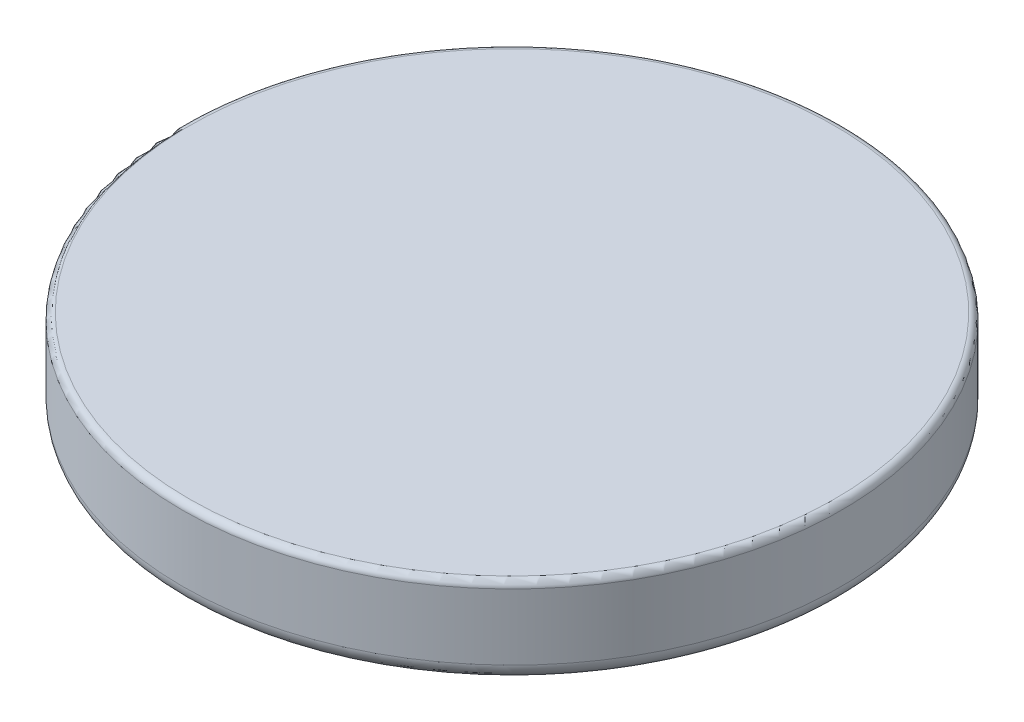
ISO-10303-21;
HEADER;
FILE_DESCRIPTION(('STEP AP214'),'2;1');
FILE_NAME('part.step','',(''),(''),'','','');
FILE_SCHEMA(('AUTOMOTIVE_DESIGN { 1 0 10303 214 1 1 1 1 }'));
ENDSEC;
DATA;
#1=APPLICATION_CONTEXT('core data for automotive mechanical design processes');
#2=APPLICATION_PROTOCOL_DEFINITION('international standard','automotive_design',2000,#1);
#3=PRODUCT_CONTEXT('',#1,'mechanical');
#4=PRODUCT('Part','Part','',(#3));
#5=PRODUCT_RELATED_PRODUCT_CATEGORY('part','',(#4));
#6=PRODUCT_DEFINITION_FORMATION('','',#4);
#7=PRODUCT_DEFINITION_CONTEXT('part definition',#1,'design');
#8=PRODUCT_DEFINITION('design','',#6,#7);
#9=PRODUCT_DEFINITION_SHAPE('','',#8);
#10=(LENGTH_UNIT() NAMED_UNIT(*) SI_UNIT(.MILLI.,.METRE.));
#11=(NAMED_UNIT(*) PLANE_ANGLE_UNIT() SI_UNIT($,.RADIAN.));
#12=(NAMED_UNIT(*) SI_UNIT($,.STERADIAN.) SOLID_ANGLE_UNIT());
#13=UNCERTAINTY_MEASURE_WITH_UNIT(LENGTH_MEASURE(1.E-05),#10,'distance_accuracy_value','');
#14=(GEOMETRIC_REPRESENTATION_CONTEXT(3) GLOBAL_UNCERTAINTY_ASSIGNED_CONTEXT((#13)) GLOBAL_UNIT_ASSIGNED_CONTEXT((#10,
#11,#12)) REPRESENTATION_CONTEXT('',''));
#15=CARTESIAN_POINT('',(0.,0.,0.));
#16=DIRECTION('',(0.,0.,1.));
#17=DIRECTION('',(1.,0.,0.));
#18=AXIS2_PLACEMENT_3D('',#15,#16,#17);
#19=CARTESIAN_POINT('',(0.,3.1,0.));
#20=DIRECTION('',(0.,-1.,0.));
#21=DIRECTION('',(0.,0.,-1.));
#22=AXIS2_PLACEMENT_3D('',#19,#20,#21);
#23=CYLINDRICAL_SURFACE('',#22,10.);
#24=CARTESIAN_POINT('',(0.,0.9,0.));
#25=DIRECTION('',(0.,-1.,0.));
#26=DIRECTION('',(0.,0.,-1.));
#27=AXIS2_PLACEMENT_3D('',#24,#25,#26);
#28=CIRCLE('',#27,10.);
#29=CARTESIAN_POINT('',(0.,0.900000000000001,-10.));
#30=VERTEX_POINT('',#29);
#31=EDGE_CURVE('E10',#30,#30,#28,.F.);
#32=CARTESIAN_POINT('',(0.,2.9,0.));
#33=DIRECTION('',(0.,1.,0.));
#34=DIRECTION('',(0.,0.,1.));
#35=AXIS2_PLACEMENT_3D('',#32,#33,#34);
#36=CIRCLE('',#35,10.);
#37=CARTESIAN_POINT('',(0.,2.9,-10.));
#38=VERTEX_POINT('',#37);
#39=EDGE_CURVE('E51',#38,#38,#36,.F.);
#40=CARTESIAN_POINT('',(0.,0.900000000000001,-10.));
#41=CARTESIAN_POINT('',(0.,0.920833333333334,-10.));
#42=CARTESIAN_POINT('',(0.,0.941666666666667,-10.));
#43=CARTESIAN_POINT('',(0.,0.983333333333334,-10.));
#44=CARTESIAN_POINT('',(0.,1.00416666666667,-10.));
#45=CARTESIAN_POINT('',(0.,1.04583333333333,-10.));
#46=CARTESIAN_POINT('',(0.,1.06666666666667,-10.));
#47=CARTESIAN_POINT('',(0.,1.10833333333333,-10.));
#48=CARTESIAN_POINT('',(0.,1.12916666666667,-10.));
#49=CARTESIAN_POINT('',(0.,1.17083333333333,-10.));
#50=CARTESIAN_POINT('',(0.,1.19166666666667,-10.));
#51=CARTESIAN_POINT('',(0.,1.23333333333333,-10.));
#52=CARTESIAN_POINT('',(0.,1.25416666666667,-10.));
#53=CARTESIAN_POINT('',(0.,1.29583333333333,-10.));
#54=CARTESIAN_POINT('',(0.,1.31666666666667,-10.));
#55=CARTESIAN_POINT('',(0.,1.35833333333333,-10.));
#56=CARTESIAN_POINT('',(0.,1.37916666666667,-10.));
#57=CARTESIAN_POINT('',(0.,1.42083333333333,-10.));
#58=CARTESIAN_POINT('',(0.,1.44166666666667,-10.));
#59=CARTESIAN_POINT('',(0.,1.48333333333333,-10.));
#60=CARTESIAN_POINT('',(0.,1.50416666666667,-10.));
#61=CARTESIAN_POINT('',(0.,1.54583333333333,-10.));
#62=CARTESIAN_POINT('',(0.,1.56666666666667,-10.));
#63=CARTESIAN_POINT('',(0.,1.60833333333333,-10.));
#64=CARTESIAN_POINT('',(0.,1.62916666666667,-10.));
#65=CARTESIAN_POINT('',(0.,1.67083333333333,-10.));
#66=CARTESIAN_POINT('',(0.,1.69166666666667,-10.));
#67=CARTESIAN_POINT('',(0.,1.73333333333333,-10.));
#68=CARTESIAN_POINT('',(0.,1.75416666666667,-10.));
#69=CARTESIAN_POINT('',(0.,1.79583333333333,-10.));
#70=CARTESIAN_POINT('',(0.,1.81666666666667,-10.));
#71=CARTESIAN_POINT('',(0.,1.85833333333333,-10.));
#72=CARTESIAN_POINT('',(0.,1.87916666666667,-10.));
#73=CARTESIAN_POINT('',(0.,1.92083333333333,-10.));
#74=CARTESIAN_POINT('',(0.,1.94166666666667,-10.));
#75=CARTESIAN_POINT('',(0.,1.98333333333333,-10.));
#76=CARTESIAN_POINT('',(0.,2.00416666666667,-10.));
#77=CARTESIAN_POINT('',(0.,2.04583333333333,-10.));
#78=CARTESIAN_POINT('',(0.,2.06666666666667,-10.));
#79=CARTESIAN_POINT('',(0.,2.10833333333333,-10.));
#80=CARTESIAN_POINT('',(0.,2.12916666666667,-10.));
#81=CARTESIAN_POINT('',(0.,2.17083333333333,-10.));
#82=CARTESIAN_POINT('',(0.,2.19166666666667,-10.));
#83=CARTESIAN_POINT('',(0.,2.23333333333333,-10.));
#84=CARTESIAN_POINT('',(0.,2.25416666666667,-10.));
#85=CARTESIAN_POINT('',(0.,2.29583333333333,-10.));
#86=CARTESIAN_POINT('',(0.,2.31666666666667,-10.));
#87=CARTESIAN_POINT('',(0.,2.35833333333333,-10.));
#88=CARTESIAN_POINT('',(0.,2.37916666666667,-10.));
#89=CARTESIAN_POINT('',(0.,2.42083333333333,-10.));
#90=CARTESIAN_POINT('',(0.,2.44166666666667,-10.));
#91=CARTESIAN_POINT('',(0.,2.48333333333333,-10.));
#92=CARTESIAN_POINT('',(0.,2.50416666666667,-10.));
#93=CARTESIAN_POINT('',(0.,2.54583333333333,-10.));
#94=CARTESIAN_POINT('',(0.,2.56666666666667,-10.));
#95=CARTESIAN_POINT('',(0.,2.60833333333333,-10.));
#96=CARTESIAN_POINT('',(0.,2.62916666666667,-10.));
#97=CARTESIAN_POINT('',(0.,2.67083333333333,-10.));
#98=CARTESIAN_POINT('',(0.,2.69166666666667,-10.));
#99=CARTESIAN_POINT('',(0.,2.73333333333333,-10.));
#100=CARTESIAN_POINT('',(0.,2.75416666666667,-10.));
#101=CARTESIAN_POINT('',(0.,2.79583333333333,-10.));
#102=CARTESIAN_POINT('',(0.,2.81666666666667,-10.));
#103=CARTESIAN_POINT('',(0.,2.85833333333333,-10.));
#104=CARTESIAN_POINT('',(0.,2.87916666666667,-10.));
#105=CARTESIAN_POINT('',(0.,2.9,-10.));
#106=B_SPLINE_CURVE_WITH_KNOTS('',3,(#40,#41,#42,#43,#44,#45,#46,#47,#48,#49,#50,#51,#52,#53,
#54,#55,#56,#57,#58,#59,#60,#61,#62,#63,#64,#65,#66,#67,#68,#69,#70,#71,#72,#73,#74,#75,#76,#77,
#78,#79,#80,#81,#82,#83,#84,#85,#86,#87,#88,#89,#90,#91,#92,#93,#94,#95,#96,#97,#98,#99,#100,
#101,#102,#103,#104,#105),.UNSPECIFIED.,.F.,.F.,(4,2,2,2,2,2,2,2,2,2,2,2,2,2,2,2,2,2,2,2,2,2,2,
2,2,2,2,2,2,2,2,2,4),(0.,0.0625000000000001,0.125,0.1875,0.25,0.3125,0.375,0.4375,0.5,
0.562499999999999,0.624999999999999,0.6875,0.75,0.812499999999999,0.874999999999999,
0.937499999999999,0.999999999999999,1.0625,1.125,1.1875,1.25,1.3125,1.375,1.4375,1.5,1.5625,
1.625,1.6875,1.75,1.8125,1.875,1.9375,2.),.UNSPECIFIED.);
#107=EDGE_CURVE('BSEAM31',#30,#38,#106,.T.);
#108=ORIENTED_EDGE('',*,*,#31,.T.);
#109=ORIENTED_EDGE('',*,*,#39,.T.);
#110=ORIENTED_EDGE('',*,*,#107,.T.);
#111=ORIENTED_EDGE('',*,*,#107,.F.);
#112=EDGE_LOOP('',(#108,#110,#109,#111));
#113=FACE_BOUND('',#112,.T.);
#114=ADVANCED_FACE('F31',(#113),#23,.T.);
#115=CARTESIAN_POINT('',(0.,3.1,0.));
#116=DIRECTION('',(0.,1.,0.));
#117=DIRECTION('',(0.,0.,1.));
#118=AXIS2_PLACEMENT_3D('',#115,#116,#117);
#119=PLANE('',#118);
#120=CARTESIAN_POINT('',(0.,3.1,0.));
#121=DIRECTION('',(0.,1.,0.));
#122=DIRECTION('',(0.,0.,1.));
#123=AXIS2_PLACEMENT_3D('',#120,#121,#122);
#124=CIRCLE('',#123,9.8);
#125=CARTESIAN_POINT('',(0.,3.1,9.8));
#126=VERTEX_POINT('',#125);
#127=EDGE_CURVE('E54',#126,#126,#124,.T.);
#128=ORIENTED_EDGE('',*,*,#127,.T.);
#129=EDGE_LOOP('',(#128));
#130=FACE_BOUND('',#129,.T.);
#131=ADVANCED_FACE('F65',(#130),#119,.T.);
#132=CARTESIAN_POINT('',(0.,0.4,0.));
#133=DIRECTION('',(0.,-1.,0.));
#134=DIRECTION('',(0.,0.,-1.));
#135=AXIS2_PLACEMENT_3D('',#132,#133,#134);
#136=PLANE('',#135);
#137=CARTESIAN_POINT('',(0.,0.4,0.));
#138=DIRECTION('',(0.,-1.,0.));
#139=DIRECTION('',(0.,0.,-1.));
#140=AXIS2_PLACEMENT_3D('',#137,#138,#139);
#141=CIRCLE('',#140,9.5);
#142=CARTESIAN_POINT('',(0.,0.4,-9.5));
#143=VERTEX_POINT('',#142);
#144=EDGE_CURVE('E38',#143,#143,#141,.T.);
#145=ORIENTED_EDGE('',*,*,#144,.T.);
#146=EDGE_LOOP('',(#145));
#147=FACE_BOUND('',#146,.T.);
#148=CARTESIAN_POINT('',(0.,0.4,0.));
#149=DIRECTION('',(0.,-1.,0.));
#150=DIRECTION('',(0.,0.,-1.));
#151=AXIS2_PLACEMENT_3D('',#148,#149,#150);
#152=CIRCLE('',#151,9.);
#153=CARTESIAN_POINT('',(0.,0.4,-9.));
#154=VERTEX_POINT('',#153);
#155=EDGE_CURVE('E57',#154,#154,#152,.T.);
#156=ORIENTED_EDGE('',*,*,#155,.F.);
#157=EDGE_LOOP('',(#156));
#158=FACE_BOUND('',#157,.T.);
#159=ADVANCED_FACE('F63',(#147,#158),#136,.T.);
#160=CARTESIAN_POINT('',(0.,0.4,0.));
#161=DIRECTION('',(0.,-1.,0.));
#162=DIRECTION('',(0.,0.,-1.));
#163=AXIS2_PLACEMENT_3D('',#160,#161,#162);
#164=CYLINDRICAL_SURFACE('',#163,9.);
#165=CARTESIAN_POINT('',(0.,0.2,0.));
#166=DIRECTION('',(0.,1.,0.));
#167=DIRECTION('',(0.,0.,1.));
#168=AXIS2_PLACEMENT_3D('',#165,#166,#167);
#169=CIRCLE('',#168,9.);
#170=CARTESIAN_POINT('',(0.,0.2,9.));
#171=VERTEX_POINT('',#170);
#172=EDGE_CURVE('E42',#171,#171,#169,.T.);
#173=ORIENTED_EDGE('',*,*,#172,.T.);
#174=EDGE_LOOP('',(#173));
#175=FACE_BOUND('',#174,.T.);
#176=ORIENTED_EDGE('',*,*,#155,.T.);
#177=EDGE_LOOP('',(#176));
#178=FACE_BOUND('',#177,.T.);
#179=ADVANCED_FACE('F61',(#175,#178),#164,.T.);
#180=CARTESIAN_POINT('',(0.,0.,0.));
#181=DIRECTION('',(0.,1.,0.));
#182=DIRECTION('',(0.,0.,1.));
#183=AXIS2_PLACEMENT_3D('',#180,#181,#182);
#184=PLANE('',#183);
#185=CARTESIAN_POINT('',(0.,0.,0.));
#186=DIRECTION('',(0.,1.,0.));
#187=DIRECTION('',(0.,0.,1.));
#188=AXIS2_PLACEMENT_3D('',#185,#186,#187);
#189=CIRCLE('',#188,8.8);
#190=CARTESIAN_POINT('',(0.,0.,8.8));
#191=VERTEX_POINT('',#190);
#192=EDGE_CURVE('E46',#191,#191,#189,.F.);
#193=ORIENTED_EDGE('',*,*,#192,.T.);
#194=EDGE_LOOP('',(#193));
#195=FACE_BOUND('',#194,.T.);
#196=ADVANCED_FACE('F71',(#195),#184,.F.);
#197=CARTESIAN_POINT('',(0.,2.9,0.));
#198=DIRECTION('',(0.,1.,0.));
#199=DIRECTION('',(0.,0.,1.));
#200=AXIS2_PLACEMENT_3D('',#197,#198,#199);
#201=TOROIDAL_SURFACE('',#200,9.8,0.2);
#202=ORIENTED_EDGE('',*,*,#39,.F.);
#203=EDGE_LOOP('',(#202));
#204=FACE_BOUND('',#203,.T.);
#205=ORIENTED_EDGE('',*,*,#127,.F.);
#206=EDGE_LOOP('',(#205));
#207=FACE_BOUND('',#206,.T.);
#208=ADVANCED_FACE('F85',(#204,#207),#201,.T.);
#209=CARTESIAN_POINT('',(0.,0.2,0.));
#210=DIRECTION('',(0.,1.,0.));
#211=DIRECTION('',(0.,0.,1.));
#212=AXIS2_PLACEMENT_3D('',#209,#210,#211);
#213=TOROIDAL_SURFACE('',#212,8.8,0.2);
#214=ORIENTED_EDGE('',*,*,#172,.F.);
#215=EDGE_LOOP('',(#214));
#216=FACE_BOUND('',#215,.T.);
#217=ORIENTED_EDGE('',*,*,#192,.F.);
#218=EDGE_LOOP('',(#217));
#219=FACE_BOUND('',#218,.T.);
#220=ADVANCED_FACE('F87',(#216,#219),#213,.T.);
#221=CARTESIAN_POINT('',(0.,0.9,0.));
#222=DIRECTION('',(0.,-1.,0.));
#223=DIRECTION('',(0.,0.,-1.));
#224=AXIS2_PLACEMENT_3D('',#221,#222,#223);
#225=TOROIDAL_SURFACE('',#224,9.5,0.5);
#226=ORIENTED_EDGE('',*,*,#31,.F.);
#227=EDGE_LOOP('',(#226));
#228=FACE_BOUND('',#227,.T.);
#229=ORIENTED_EDGE('',*,*,#144,.F.);
#230=EDGE_LOOP('',(#229));
#231=FACE_BOUND('',#230,.T.);
#232=ADVANCED_FACE('F33',(#228,#231),#225,.T.);
#233=CLOSED_SHELL('',(#114,#131,#159,#179,#196,#208,#220,#232));
#234=MANIFOLD_SOLID_BREP('B2',#233);
#235=ADVANCED_BREP_SHAPE_REPRESENTATION('',(#18,#234),#14);
#236=SHAPE_DEFINITION_REPRESENTATION(#9,#235);
ENDSEC;
END-ISO-10303-21;
